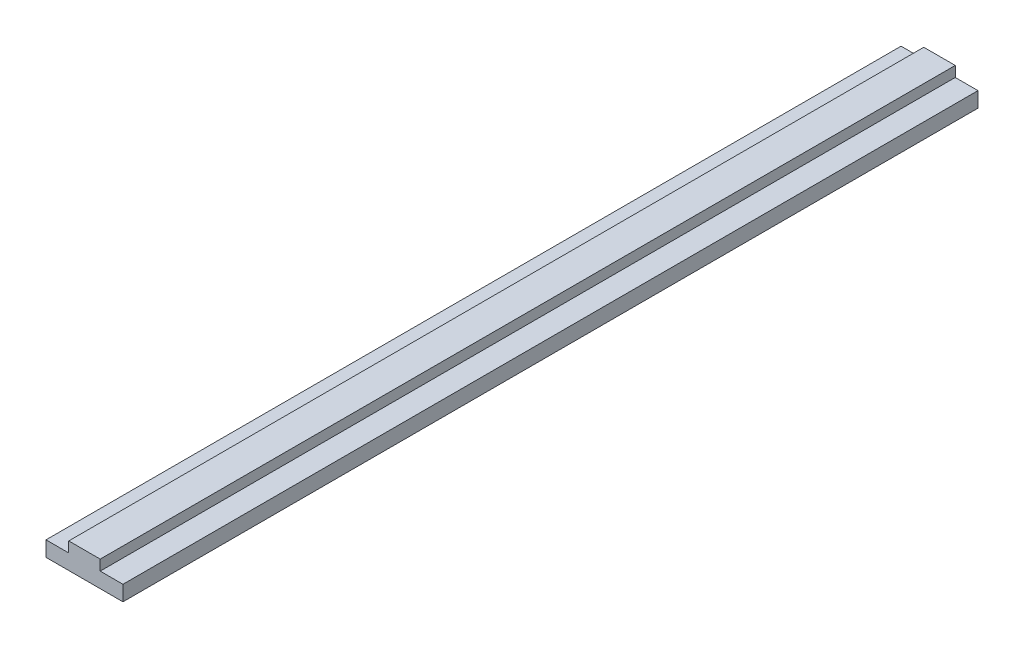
ISO-10303-21;
HEADER;
FILE_DESCRIPTION(('STEP AP214'),'2;1');
FILE_NAME('part.step','',(''),(''),'','','');
FILE_SCHEMA(('AUTOMOTIVE_DESIGN { 1 0 10303 214 1 1 1 1 }'));
ENDSEC;
DATA;
#1=APPLICATION_CONTEXT('core data for automotive mechanical design processes');
#2=APPLICATION_PROTOCOL_DEFINITION('international standard','automotive_design',2000,#1);
#3=PRODUCT_CONTEXT('',#1,'mechanical');
#4=PRODUCT('Part','Part','',(#3));
#5=PRODUCT_RELATED_PRODUCT_CATEGORY('part','',(#4));
#6=PRODUCT_DEFINITION_FORMATION('','',#4);
#7=PRODUCT_DEFINITION_CONTEXT('part definition',#1,'design');
#8=PRODUCT_DEFINITION('design','',#6,#7);
#9=PRODUCT_DEFINITION_SHAPE('','',#8);
#10=(LENGTH_UNIT() NAMED_UNIT(*) SI_UNIT(.MILLI.,.METRE.));
#11=(NAMED_UNIT(*) PLANE_ANGLE_UNIT() SI_UNIT($,.RADIAN.));
#12=(NAMED_UNIT(*) SI_UNIT($,.STERADIAN.) SOLID_ANGLE_UNIT());
#13=UNCERTAINTY_MEASURE_WITH_UNIT(LENGTH_MEASURE(1.E-05),#10,'distance_accuracy_value','');
#14=(GEOMETRIC_REPRESENTATION_CONTEXT(3) GLOBAL_UNCERTAINTY_ASSIGNED_CONTEXT((#13)) GLOBAL_UNIT_ASSIGNED_CONTEXT((#10,
#11,#12)) REPRESENTATION_CONTEXT('',''));
#15=CARTESIAN_POINT('',(0.,0.,0.));
#16=DIRECTION('',(0.,0.,1.));
#17=DIRECTION('',(1.,0.,0.));
#18=AXIS2_PLACEMENT_3D('',#15,#16,#17);
#19=CARTESIAN_POINT('',(22.5,8.9,0.));
#20=DIRECTION('',(-1.,0.,0.));
#21=DIRECTION('',(0.,0.,1.));
#22=AXIS2_PLACEMENT_3D('',#19,#20,#21);
#23=PLANE('',#22);
#24=DIRECTION('',(0.,-1.,0.));
#25=VECTOR('',#24,1.);
#26=CARTESIAN_POINT('',(22.5,8.9,500.));
#27=LINE('',#26,#25);
#28=CARTESIAN_POINT('',(22.5,8.9,500.));
#29=VERTEX_POINT('',#28);
#30=CARTESIAN_POINT('',(22.5,0.,500.));
#31=VERTEX_POINT('',#30);
#32=EDGE_CURVE('E112',#29,#31,#27,.T.);
#33=ORIENTED_EDGE('',*,*,#32,.T.);
#34=DIRECTION('',(0.,0.,1.));
#35=VECTOR('',#34,1.);
#36=CARTESIAN_POINT('',(22.5,0.,0.));
#37=LINE('',#36,#35);
#38=CARTESIAN_POINT('',(22.5,0.,0.));
#39=VERTEX_POINT('',#38);
#40=EDGE_CURVE('E9',#39,#31,#37,.T.);
#41=ORIENTED_EDGE('',*,*,#40,.F.);
#42=DIRECTION('',(0.,-1.,0.));
#43=VECTOR('',#42,1.);
#44=CARTESIAN_POINT('',(22.5,8.9,0.));
#45=LINE('',#44,#43);
#46=CARTESIAN_POINT('',(22.5,8.9,0.));
#47=VERTEX_POINT('',#46);
#48=EDGE_CURVE('E130',#47,#39,#45,.T.);
#49=ORIENTED_EDGE('',*,*,#48,.F.);
#50=DIRECTION('',(0.,0.,1.));
#51=VECTOR('',#50,1.);
#52=CARTESIAN_POINT('',(22.5,8.9,0.));
#53=LINE('',#52,#51);
#54=EDGE_CURVE('E111',#47,#29,#53,.T.);
#55=ORIENTED_EDGE('',*,*,#54,.T.);
#56=EDGE_LOOP('',(#33,#41,#49,#55));
#57=FACE_BOUND('',#56,.T.);
#58=ADVANCED_FACE('F14',(#57),#23,.F.);
#59=CARTESIAN_POINT('',(22.5,0.,0.));
#60=DIRECTION('',(0.,1.,0.));
#61=DIRECTION('',(0.,0.,1.));
#62=AXIS2_PLACEMENT_3D('',#59,#60,#61);
#63=PLANE('',#62);
#64=DIRECTION('',(-1.,0.,0.));
#65=VECTOR('',#64,1.);
#66=CARTESIAN_POINT('',(22.5,0.,500.));
#67=LINE('',#66,#65);
#68=CARTESIAN_POINT('',(-22.5,0.,500.));
#69=VERTEX_POINT('',#68);
#70=EDGE_CURVE('E115',#31,#69,#67,.T.);
#71=ORIENTED_EDGE('',*,*,#70,.T.);
#72=DIRECTION('',(0.,0.,1.));
#73=VECTOR('',#72,1.);
#74=CARTESIAN_POINT('',(-22.5,0.,0.));
#75=LINE('',#74,#73);
#76=CARTESIAN_POINT('',(-22.5,0.,0.));
#77=VERTEX_POINT('',#76);
#78=EDGE_CURVE('E22',#77,#69,#75,.T.);
#79=ORIENTED_EDGE('',*,*,#78,.F.);
#80=DIRECTION('',(-1.,0.,0.));
#81=VECTOR('',#80,1.);
#82=CARTESIAN_POINT('',(22.5,0.,0.));
#83=LINE('',#82,#81);
#84=EDGE_CURVE('E72',#39,#77,#83,.T.);
#85=ORIENTED_EDGE('',*,*,#84,.F.);
#86=ORIENTED_EDGE('',*,*,#40,.T.);
#87=EDGE_LOOP('',(#71,#79,#85,#86));
#88=FACE_BOUND('',#87,.T.);
#89=ADVANCED_FACE('F143',(#88),#63,.F.);
#90=CARTESIAN_POINT('',(-22.5,8.9,0.));
#91=DIRECTION('',(-1.,0.,0.));
#92=DIRECTION('',(0.,0.,1.));
#93=AXIS2_PLACEMENT_3D('',#90,#91,#92);
#94=PLANE('',#93);
#95=DIRECTION('',(0.,-1.,0.));
#96=VECTOR('',#95,1.);
#97=CARTESIAN_POINT('',(-22.5,8.9,500.));
#98=LINE('',#97,#96);
#99=CARTESIAN_POINT('',(-22.5,8.9,500.));
#100=VERTEX_POINT('',#99);
#101=EDGE_CURVE('E118',#100,#69,#98,.T.);
#102=ORIENTED_EDGE('',*,*,#101,.F.);
#103=DIRECTION('',(0.,0.,1.));
#104=VECTOR('',#103,1.);
#105=CARTESIAN_POINT('',(-22.5,8.9,0.));
#106=LINE('',#105,#104);
#107=CARTESIAN_POINT('',(-22.5,8.9,0.));
#108=VERTEX_POINT('',#107);
#109=EDGE_CURVE('E136',#108,#100,#106,.T.);
#110=ORIENTED_EDGE('',*,*,#109,.F.);
#111=DIRECTION('',(0.,-1.,0.));
#112=VECTOR('',#111,1.);
#113=CARTESIAN_POINT('',(-22.5,8.9,0.));
#114=LINE('',#113,#112);
#115=EDGE_CURVE('E142',#108,#77,#114,.T.);
#116=ORIENTED_EDGE('',*,*,#115,.T.);
#117=ORIENTED_EDGE('',*,*,#78,.T.);
#118=EDGE_LOOP('',(#102,#110,#116,#117));
#119=FACE_BOUND('',#118,.T.);
#120=ADVANCED_FACE('F140',(#119),#94,.T.);
#121=CARTESIAN_POINT('',(-9.20000000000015,8.9,0.));
#122=DIRECTION('',(0.,1.,0.));
#123=DIRECTION('',(-1.,0.,0.));
#124=AXIS2_PLACEMENT_3D('',#121,#122,#123);
#125=PLANE('',#124);
#126=DIRECTION('',(-1.,0.,0.));
#127=VECTOR('',#126,1.);
#128=CARTESIAN_POINT('',(-9.20000000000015,8.9,500.));
#129=LINE('',#128,#127);
#130=CARTESIAN_POINT('',(-9.20000000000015,8.9,500.));
#131=VERTEX_POINT('',#130);
#132=EDGE_CURVE('E121',#131,#100,#129,.T.);
#133=ORIENTED_EDGE('',*,*,#132,.F.);
#134=DIRECTION('',(0.,0.,1.));
#135=VECTOR('',#134,1.);
#136=CARTESIAN_POINT('',(-9.20000000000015,8.9,0.));
#137=LINE('',#136,#135);
#138=CARTESIAN_POINT('',(-9.20000000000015,8.9,0.));
#139=VERTEX_POINT('',#138);
#140=EDGE_CURVE('E134',#139,#131,#137,.T.);
#141=ORIENTED_EDGE('',*,*,#140,.F.);
#142=DIRECTION('',(-1.,0.,0.));
#143=VECTOR('',#142,1.);
#144=CARTESIAN_POINT('',(-9.20000000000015,8.9,0.));
#145=LINE('',#144,#143);
#146=EDGE_CURVE('E106',#139,#108,#145,.T.);
#147=ORIENTED_EDGE('',*,*,#146,.T.);
#148=ORIENTED_EDGE('',*,*,#109,.T.);
#149=EDGE_LOOP('',(#133,#141,#147,#148));
#150=FACE_BOUND('',#149,.T.);
#151=ADVANCED_FACE('F151',(#150),#125,.T.);
#152=CARTESIAN_POINT('',(-9.20000000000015,15.,0.));
#153=DIRECTION('',(-1.,0.,0.));
#154=DIRECTION('',(0.,0.,1.));
#155=AXIS2_PLACEMENT_3D('',#152,#153,#154);
#156=PLANE('',#155);
#157=DIRECTION('',(0.,-1.,0.));
#158=VECTOR('',#157,1.);
#159=CARTESIAN_POINT('',(-9.20000000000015,15.,500.));
#160=LINE('',#159,#158);
#161=CARTESIAN_POINT('',(-9.20000000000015,15.,500.));
#162=VERTEX_POINT('',#161);
#163=EDGE_CURVE('E124',#162,#131,#160,.T.);
#164=ORIENTED_EDGE('',*,*,#163,.F.);
#165=DIRECTION('',(0.,0.,1.));
#166=VECTOR('',#165,1.);
#167=CARTESIAN_POINT('',(-9.20000000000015,15.,0.));
#168=LINE('',#167,#166);
#169=CARTESIAN_POINT('',(-9.20000000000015,15.,0.));
#170=VERTEX_POINT('',#169);
#171=EDGE_CURVE('E94',#170,#162,#168,.T.);
#172=ORIENTED_EDGE('',*,*,#171,.F.);
#173=DIRECTION('',(0.,-1.,0.));
#174=VECTOR('',#173,1.);
#175=CARTESIAN_POINT('',(-9.20000000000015,15.,0.));
#176=LINE('',#175,#174);
#177=EDGE_CURVE('E104',#170,#139,#176,.T.);
#178=ORIENTED_EDGE('',*,*,#177,.T.);
#179=ORIENTED_EDGE('',*,*,#140,.T.);
#180=EDGE_LOOP('',(#164,#172,#178,#179));
#181=FACE_BOUND('',#180,.T.);
#182=ADVANCED_FACE('F183',(#181),#156,.T.);
#183=CARTESIAN_POINT('',(9.2,15.,0.));
#184=DIRECTION('',(0.,1.,0.));
#185=DIRECTION('',(-1.,0.,0.));
#186=AXIS2_PLACEMENT_3D('',#183,#184,#185);
#187=PLANE('',#186);
#188=DIRECTION('',(-1.,0.,0.));
#189=VECTOR('',#188,1.);
#190=CARTESIAN_POINT('',(9.2,15.,500.));
#191=LINE('',#190,#189);
#192=CARTESIAN_POINT('',(9.2,15.,500.));
#193=VERTEX_POINT('',#192);
#194=EDGE_CURVE('E93',#193,#162,#191,.T.);
#195=ORIENTED_EDGE('',*,*,#194,.F.);
#196=DIRECTION('',(0.,0.,1.));
#197=VECTOR('',#196,1.);
#198=CARTESIAN_POINT('',(9.2,15.,0.));
#199=LINE('',#198,#197);
#200=CARTESIAN_POINT('',(9.2,15.,0.));
#201=VERTEX_POINT('',#200);
#202=EDGE_CURVE('E87',#201,#193,#199,.T.);
#203=ORIENTED_EDGE('',*,*,#202,.F.);
#204=DIRECTION('',(-1.,0.,0.));
#205=VECTOR('',#204,1.);
#206=CARTESIAN_POINT('',(9.2,15.,0.));
#207=LINE('',#206,#205);
#208=EDGE_CURVE('E91',#201,#170,#207,.T.);
#209=ORIENTED_EDGE('',*,*,#208,.T.);
#210=ORIENTED_EDGE('',*,*,#171,.T.);
#211=EDGE_LOOP('',(#195,#203,#209,#210));
#212=FACE_BOUND('',#211,.T.);
#213=ADVANCED_FACE('F89',(#212),#187,.T.);
#214=CARTESIAN_POINT('',(9.2,15.,0.));
#215=DIRECTION('',(-1.,0.,0.));
#216=DIRECTION('',(0.,0.,1.));
#217=AXIS2_PLACEMENT_3D('',#214,#215,#216);
#218=PLANE('',#217);
#219=DIRECTION('',(0.,-1.,0.));
#220=VECTOR('',#219,1.);
#221=CARTESIAN_POINT('',(9.2,15.,500.));
#222=LINE('',#221,#220);
#223=CARTESIAN_POINT('',(9.2,8.9,500.));
#224=VERTEX_POINT('',#223);
#225=EDGE_CURVE('E58',#193,#224,#222,.T.);
#226=ORIENTED_EDGE('',*,*,#225,.T.);
#227=DIRECTION('',(0.,0.,1.));
#228=VECTOR('',#227,1.);
#229=CARTESIAN_POINT('',(9.2,8.9,0.));
#230=LINE('',#229,#228);
#231=CARTESIAN_POINT('',(9.2,8.9,0.));
#232=VERTEX_POINT('',#231);
#233=EDGE_CURVE('E95',#232,#224,#230,.T.);
#234=ORIENTED_EDGE('',*,*,#233,.F.);
#235=DIRECTION('',(0.,-1.,0.));
#236=VECTOR('',#235,1.);
#237=CARTESIAN_POINT('',(9.2,15.,0.));
#238=LINE('',#237,#236);
#239=EDGE_CURVE('E97',#201,#232,#238,.T.);
#240=ORIENTED_EDGE('',*,*,#239,.F.);
#241=ORIENTED_EDGE('',*,*,#202,.T.);
#242=EDGE_LOOP('',(#226,#234,#240,#241));
#243=FACE_BOUND('',#242,.T.);
#244=ADVANCED_FACE('F98',(#243),#218,.F.);
#245=CARTESIAN_POINT('',(9.2,8.9,0.));
#246=DIRECTION('',(0.,-1.,0.));
#247=DIRECTION('',(1.,0.,0.));
#248=AXIS2_PLACEMENT_3D('',#245,#246,#247);
#249=PLANE('',#248);
#250=DIRECTION('',(1.,0.,0.));
#251=VECTOR('',#250,1.);
#252=CARTESIAN_POINT('',(9.2,8.9,500.));
#253=LINE('',#252,#251);
#254=EDGE_CURVE('E64',#224,#29,#253,.T.);
#255=ORIENTED_EDGE('',*,*,#254,.T.);
#256=ORIENTED_EDGE('',*,*,#54,.F.);
#257=DIRECTION('',(1.,0.,0.));
#258=VECTOR('',#257,1.);
#259=CARTESIAN_POINT('',(9.2,8.9,0.));
#260=LINE('',#259,#258);
#261=EDGE_CURVE('E30',#232,#47,#260,.T.);
#262=ORIENTED_EDGE('',*,*,#261,.F.);
#263=ORIENTED_EDGE('',*,*,#233,.T.);
#264=EDGE_LOOP('',(#255,#256,#262,#263));
#265=FACE_BOUND('',#264,.T.);
#266=ADVANCED_FACE('F158',(#265),#249,.F.);
#267=CARTESIAN_POINT('',(22.5,0.,0.));
#268=DIRECTION('',(0.,0.,-1.));
#269=DIRECTION('',(-1.,0.,0.));
#270=AXIS2_PLACEMENT_3D('',#267,#268,#269);
#271=PLANE('',#270);
#272=ORIENTED_EDGE('',*,*,#48,.T.);
#273=ORIENTED_EDGE('',*,*,#84,.T.);
#274=ORIENTED_EDGE('',*,*,#115,.F.);
#275=ORIENTED_EDGE('',*,*,#146,.F.);
#276=ORIENTED_EDGE('',*,*,#177,.F.);
#277=ORIENTED_EDGE('',*,*,#208,.F.);
#278=ORIENTED_EDGE('',*,*,#239,.T.);
#279=ORIENTED_EDGE('',*,*,#261,.T.);
#280=EDGE_LOOP('',(#272,#273,#274,#275,#276,#277,#278,#279));
#281=FACE_BOUND('',#280,.T.);
#282=ADVANCED_FACE('F101',(#281),#271,.T.);
#283=CARTESIAN_POINT('',(22.5,0.,500.));
#284=DIRECTION('',(0.,0.,-1.));
#285=DIRECTION('',(-1.,0.,0.));
#286=AXIS2_PLACEMENT_3D('',#283,#284,#285);
#287=PLANE('',#286);
#288=ORIENTED_EDGE('',*,*,#32,.F.);
#289=ORIENTED_EDGE('',*,*,#254,.F.);
#290=ORIENTED_EDGE('',*,*,#225,.F.);
#291=ORIENTED_EDGE('',*,*,#194,.T.);
#292=ORIENTED_EDGE('',*,*,#163,.T.);
#293=ORIENTED_EDGE('',*,*,#132,.T.);
#294=ORIENTED_EDGE('',*,*,#101,.T.);
#295=ORIENTED_EDGE('',*,*,#70,.F.);
#296=EDGE_LOOP('',(#288,#289,#290,#291,#292,#293,#294,#295));
#297=FACE_BOUND('',#296,.T.);
#298=ADVANCED_FACE('F147',(#297),#287,.F.);
#299=CLOSED_SHELL('',(#58,#89,#120,#151,#182,#213,#244,#266,#282,#298));
#300=MANIFOLD_SOLID_BREP('B1',#299);
#301=ADVANCED_BREP_SHAPE_REPRESENTATION('',(#18,#300),#14);
#302=SHAPE_DEFINITION_REPRESENTATION(#9,#301);
ENDSEC;
END-ISO-10303-21;
